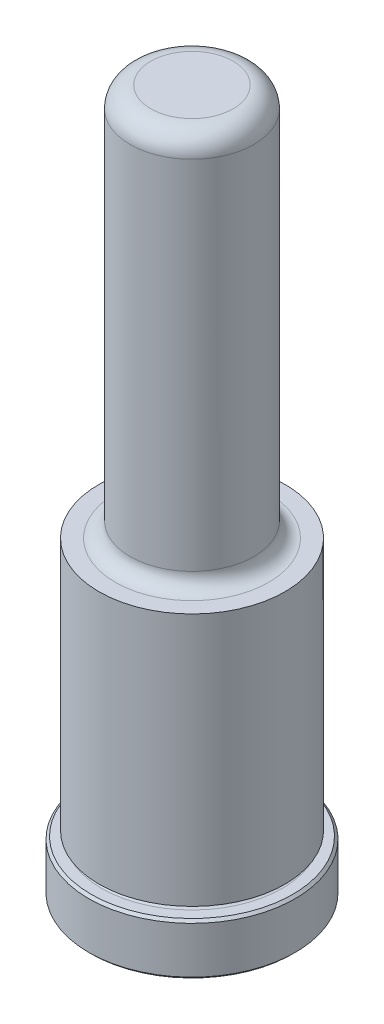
from build123d import *

# Parameters (mm, degrees)
CHAMFER1_SIZE = 0.381
FILLET1_R     = 3.175


with BuildPart() as part:
    # Sketch1 → Revolve1 (revolve)
    with BuildSketch(Plane(origin=(0, 0, 0), x_dir=(0, 0, -1), z_dir=(1, 0, 0)), mode=Mode.PRIVATE) as revolve1_sk:
        with BuildLine():
            Line((0, 0), (15.875, 0))
            Line((15.875, 0), (15.875, 7.9248))
            Line((15.875, 7.9248), (13.8938, 7.9248))
            ThreePointArc((13.8938, 7.9248), (13.5128, 8.3058), (13.8938, 8.6868))
            Line((13.8938, 8.6868), (14.3002, 8.6868))
            Line((14.3002, 8.6868), (14.3002, 47.625))
            Line((14.3002, 47.625), (11.7983, 47.625))
            ThreePointArc((11.7983, 47.625), (10.181853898, 48.294553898), (9.5123, 49.911))
            Line((9.5123, 49.911), (9.5123, 107.95))
            Line((9.5123, 107.95), (0, 107.95))
            Line((0, 107.95), (0, 0))
        make_face()
    revolve(revolve1_sk.sketch.rotate(Axis((0, 0, 0), (0, -1, 0)), 180), axis=Axis((0, 0, 0), (0, -1, 0)))

    # Chamfer1
    chamfer1_edges = [part.edges().sort_by_distance(p)[0] for p in [
        (0, 7.9248, -15.875),
        (0, 0, -15.875),
    ]]
    chamfer(chamfer1_edges, length=CHAMFER1_SIZE)

    # Fillet1
    fillet1_edges = [part.edges().sort_by_distance(p)[0] for p in [
        (0, 107.95, -9.5123),
    ]]
    fillet(fillet1_edges, radius=FILLET1_R)


solid = part.part
